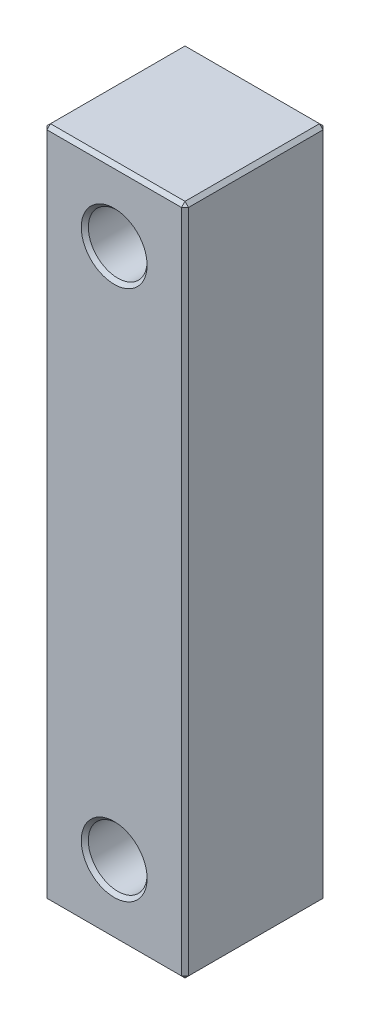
ISO-10303-21;
HEADER;
FILE_DESCRIPTION(('STEP AP214'),'2;1');
FILE_NAME('part.step','',(''),(''),'','','');
FILE_SCHEMA(('AUTOMOTIVE_DESIGN { 1 0 10303 214 1 1 1 1 }'));
ENDSEC;
DATA;
#1=APPLICATION_CONTEXT('core data for automotive mechanical design processes');
#2=APPLICATION_PROTOCOL_DEFINITION('international standard','automotive_design',2000,#1);
#3=PRODUCT_CONTEXT('',#1,'mechanical');
#4=PRODUCT('Part','Part','',(#3));
#5=PRODUCT_RELATED_PRODUCT_CATEGORY('part','',(#4));
#6=PRODUCT_DEFINITION_FORMATION('','',#4);
#7=PRODUCT_DEFINITION_CONTEXT('part definition',#1,'design');
#8=PRODUCT_DEFINITION('design','',#6,#7);
#9=PRODUCT_DEFINITION_SHAPE('','',#8);
#10=(LENGTH_UNIT() NAMED_UNIT(*) SI_UNIT(.MILLI.,.METRE.));
#11=(NAMED_UNIT(*) PLANE_ANGLE_UNIT() SI_UNIT($,.RADIAN.));
#12=(NAMED_UNIT(*) SI_UNIT($,.STERADIAN.) SOLID_ANGLE_UNIT());
#13=UNCERTAINTY_MEASURE_WITH_UNIT(LENGTH_MEASURE(1.E-05),#10,'distance_accuracy_value','');
#14=(GEOMETRIC_REPRESENTATION_CONTEXT(3) GLOBAL_UNCERTAINTY_ASSIGNED_CONTEXT((#13)) GLOBAL_UNIT_ASSIGNED_CONTEXT((#10,
#11,#12)) REPRESENTATION_CONTEXT('',''));
#15=CARTESIAN_POINT('',(0.,0.,0.));
#16=DIRECTION('',(0.,0.,1.));
#17=DIRECTION('',(1.,0.,0.));
#18=AXIS2_PLACEMENT_3D('',#15,#16,#17);
#19=CARTESIAN_POINT('',(-47.5000000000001,-47.5,-20.));
#20=DIRECTION('',(0.,0.,-1.));
#21=DIRECTION('',(-1.,0.,0.));
#22=AXIS2_PLACEMENT_3D('',#19,#20,#21);
#23=PLANE('',#22);
#24=CARTESIAN_POINT('',(-37.5000000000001,37.5,-20.));
#25=DIRECTION('',(0.,0.,-1.));
#26=DIRECTION('',(-1.,0.,0.));
#27=AXIS2_PLACEMENT_3D('',#24,#25,#26);
#28=CIRCLE('',#27,4.65);
#29=CARTESIAN_POINT('',(-42.1500000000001,37.5,-20.));
#30=VERTEX_POINT('',#29);
#31=EDGE_CURVE('E205',#30,#30,#28,.F.);
#32=ORIENTED_EDGE('',*,*,#31,.T.);
#33=EDGE_LOOP('',(#32));
#34=FACE_BOUND('',#33,.T.);
#35=CARTESIAN_POINT('',(-37.5000000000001,-37.5,-20.));
#36=DIRECTION('',(0.,0.,-1.));
#37=DIRECTION('',(-1.,0.,0.));
#38=AXIS2_PLACEMENT_3D('',#35,#36,#37);
#39=CIRCLE('',#38,4.65000000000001);
#40=CARTESIAN_POINT('',(-42.1500000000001,-37.5,-20.));
#41=VERTEX_POINT('',#40);
#42=EDGE_CURVE('E202',#41,#41,#39,.F.);
#43=ORIENTED_EDGE('',*,*,#42,.T.);
#44=EDGE_LOOP('',(#43));
#45=FACE_BOUND('',#44,.T.);
#46=DIRECTION('',(0.,-1.,0.));
#47=VECTOR('',#46,1.);
#48=CARTESIAN_POINT('',(-28.,-47.5000000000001,-20.));
#49=LINE('',#48,#47);
#50=CARTESIAN_POINT('',(-28.0000000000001,46.9999999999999,-20.));
#51=VERTEX_POINT('',#50);
#52=CARTESIAN_POINT('',(-28.0000000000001,-47.0000000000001,-20.));
#53=VERTEX_POINT('',#52);
#54=EDGE_CURVE('E197',#51,#53,#49,.T.);
#55=ORIENTED_EDGE('',*,*,#54,.T.);
#56=DIRECTION('',(-1.,0.,0.));
#57=VECTOR('',#56,1.);
#58=CARTESIAN_POINT('',(-47.5,-47.,-20.));
#59=LINE('',#58,#57);
#60=CARTESIAN_POINT('',(-47.0000000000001,-47.0000000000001,-20.));
#61=VERTEX_POINT('',#60);
#62=EDGE_CURVE('E199',#53,#61,#59,.T.);
#63=ORIENTED_EDGE('',*,*,#62,.T.);
#64=DIRECTION('',(0.,0.999999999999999,0.));
#65=VECTOR('',#64,1.);
#66=CARTESIAN_POINT('',(-47.,-47.5000000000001,-20.));
#67=LINE('',#66,#65);
#68=CARTESIAN_POINT('',(-47.0000000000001,46.9999999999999,-20.));
#69=VERTEX_POINT('',#68);
#70=EDGE_CURVE('E193',#61,#69,#67,.T.);
#71=ORIENTED_EDGE('',*,*,#70,.T.);
#72=DIRECTION('',(1.,0.,0.));
#73=VECTOR('',#72,1.);
#74=CARTESIAN_POINT('',(-27.5000000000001,47.,-20.));
#75=LINE('',#74,#73);
#76=EDGE_CURVE('E195',#69,#51,#75,.T.);
#77=ORIENTED_EDGE('',*,*,#76,.T.);
#78=EDGE_LOOP('',(#55,#63,#71,#77));
#79=FACE_BOUND('',#78,.T.);
#80=ADVANCED_FACE('F34',(#34,#45,#79),#23,.T.);
#81=CARTESIAN_POINT('',(-47.5000000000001,-47.5,0.));
#82=DIRECTION('',(0.,0.,-1.));
#83=DIRECTION('',(-1.,0.,0.));
#84=AXIS2_PLACEMENT_3D('',#81,#82,#83);
#85=PLANE('',#84);
#86=CARTESIAN_POINT('',(-37.5000000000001,37.5,0.));
#87=DIRECTION('',(0.,0.,-1.));
#88=DIRECTION('',(-1.,0.,0.));
#89=AXIS2_PLACEMENT_3D('',#86,#87,#88);
#90=CIRCLE('',#89,4.65000000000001);
#91=CARTESIAN_POINT('',(-42.1500000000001,37.4999999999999,0.));
#92=VERTEX_POINT('',#91);
#93=EDGE_CURVE('E11',#92,#92,#90,.T.);
#94=ORIENTED_EDGE('',*,*,#93,.T.);
#95=EDGE_LOOP('',(#94));
#96=FACE_BOUND('',#95,.T.);
#97=CARTESIAN_POINT('',(-37.5000000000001,-37.5,0.));
#98=DIRECTION('',(0.,0.,-1.));
#99=DIRECTION('',(-1.,0.,0.));
#100=AXIS2_PLACEMENT_3D('',#97,#98,#99);
#101=CIRCLE('',#100,4.65);
#102=CARTESIAN_POINT('',(-42.1500000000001,-37.5,0.));
#103=VERTEX_POINT('',#102);
#104=EDGE_CURVE('E42',#103,#103,#101,.T.);
#105=ORIENTED_EDGE('',*,*,#104,.T.);
#106=EDGE_LOOP('',(#105));
#107=FACE_BOUND('',#106,.T.);
#108=DIRECTION('',(0.,1.,0.));
#109=VECTOR('',#108,1.);
#110=CARTESIAN_POINT('',(-28.0000000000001,47.5,0.));
#111=LINE('',#110,#109);
#112=CARTESIAN_POINT('',(-28.0000000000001,-47.,0.));
#113=VERTEX_POINT('',#112);
#114=CARTESIAN_POINT('',(-28.0000000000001,47.,0.));
#115=VERTEX_POINT('',#114);
#116=EDGE_CURVE('E49',#113,#115,#111,.T.);
#117=ORIENTED_EDGE('',*,*,#116,.T.);
#118=DIRECTION('',(-1.,0.,0.));
#119=VECTOR('',#118,1.);
#120=CARTESIAN_POINT('',(-47.5000000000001,47.,0.));
#121=LINE('',#120,#119);
#122=CARTESIAN_POINT('',(-47.0000000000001,46.9999999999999,0.));
#123=VERTEX_POINT('',#122);
#124=EDGE_CURVE('E218',#115,#123,#121,.T.);
#125=ORIENTED_EDGE('',*,*,#124,.T.);
#126=DIRECTION('',(0.,-0.999999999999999,0.));
#127=VECTOR('',#126,1.);
#128=CARTESIAN_POINT('',(-47.,-47.5,0.));
#129=LINE('',#128,#127);
#130=CARTESIAN_POINT('',(-47.0000000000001,-47.0000000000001,0.));
#131=VERTEX_POINT('',#130);
#132=EDGE_CURVE('E214',#123,#131,#129,.T.);
#133=ORIENTED_EDGE('',*,*,#132,.T.);
#134=DIRECTION('',(1.,0.,0.));
#135=VECTOR('',#134,1.);
#136=CARTESIAN_POINT('',(-47.5,-47.0000000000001,0.));
#137=LINE('',#136,#135);
#138=EDGE_CURVE('E54',#131,#113,#137,.T.);
#139=ORIENTED_EDGE('',*,*,#138,.T.);
#140=EDGE_LOOP('',(#117,#125,#133,#139));
#141=FACE_BOUND('',#140,.T.);
#142=ADVANCED_FACE('F222',(#96,#107,#141),#85,.F.);
#143=CARTESIAN_POINT('',(-47.5000000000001,47.4999999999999,-20.));
#144=DIRECTION('',(-1.,0.,0.));
#145=DIRECTION('',(0.,-0.999999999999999,0.));
#146=AXIS2_PLACEMENT_3D('',#143,#144,#145);
#147=PLANE('',#146);
#148=DIRECTION('',(0.,0.,-1.));
#149=VECTOR('',#148,1.);
#150=CARTESIAN_POINT('',(-47.5000000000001,46.9999999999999,-20.));
#151=LINE('',#150,#149);
#152=CARTESIAN_POINT('',(-47.5000000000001,46.9999999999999,-0.5));
#153=VERTEX_POINT('',#152);
#154=CARTESIAN_POINT('',(-47.5000000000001,47.,-19.5));
#155=VERTEX_POINT('',#154);
#156=EDGE_CURVE('E173',#153,#155,#151,.T.);
#157=ORIENTED_EDGE('',*,*,#156,.T.);
#158=DIRECTION('',(0.,-0.999999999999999,0.));
#159=VECTOR('',#158,1.);
#160=CARTESIAN_POINT('',(-47.5000000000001,47.4999999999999,-19.5));
#161=LINE('',#160,#159);
#162=CARTESIAN_POINT('',(-47.5000000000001,-47.0000000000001,-19.5));
#163=VERTEX_POINT('',#162);
#164=EDGE_CURVE('E176',#155,#163,#161,.T.);
#165=ORIENTED_EDGE('',*,*,#164,.T.);
#166=DIRECTION('',(0.,0.,1.));
#167=VECTOR('',#166,1.);
#168=CARTESIAN_POINT('',(-47.5,-47.0000000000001,0.));
#169=LINE('',#168,#167);
#170=CARTESIAN_POINT('',(-47.5,-47.0000000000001,-0.499999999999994));
#171=VERTEX_POINT('',#170);
#172=EDGE_CURVE('E171',#163,#171,#169,.T.);
#173=ORIENTED_EDGE('',*,*,#172,.T.);
#174=DIRECTION('',(0.,0.999999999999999,0.));
#175=VECTOR('',#174,1.);
#176=CARTESIAN_POINT('',(-47.5000000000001,47.4999999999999,-0.499999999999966));
#177=LINE('',#176,#175);
#178=EDGE_CURVE('E169',#171,#153,#177,.T.);
#179=ORIENTED_EDGE('',*,*,#178,.T.);
#180=EDGE_LOOP('',(#157,#165,#173,#179));
#181=FACE_BOUND('',#180,.T.);
#182=ADVANCED_FACE('F253',(#181),#147,.T.);
#183=CARTESIAN_POINT('',(-47.5000000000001,47.4999999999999,-20.));
#184=DIRECTION('',(0.,-1.,0.));
#185=DIRECTION('',(1.,0.,0.));
#186=AXIS2_PLACEMENT_3D('',#183,#184,#185);
#187=PLANE('',#186);
#188=DIRECTION('',(0.,0.,-1.));
#189=VECTOR('',#188,1.);
#190=CARTESIAN_POINT('',(-28.0000000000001,47.5,-20.));
#191=LINE('',#190,#189);
#192=CARTESIAN_POINT('',(-28.0000000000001,47.5,-0.500000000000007));
#193=VERTEX_POINT('',#192);
#194=CARTESIAN_POINT('',(-28.0000000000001,47.5,-19.5));
#195=VERTEX_POINT('',#194);
#196=EDGE_CURVE('E130',#193,#195,#191,.T.);
#197=ORIENTED_EDGE('',*,*,#196,.T.);
#198=DIRECTION('',(-1.,0.,0.));
#199=VECTOR('',#198,1.);
#200=CARTESIAN_POINT('',(-47.5000000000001,47.4999999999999,-19.5));
#201=LINE('',#200,#199);
#202=CARTESIAN_POINT('',(-47.0000000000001,47.4999999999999,-19.5));
#203=VERTEX_POINT('',#202);
#204=EDGE_CURVE('E167',#195,#203,#201,.T.);
#205=ORIENTED_EDGE('',*,*,#204,.T.);
#206=DIRECTION('',(0.,0.,1.));
#207=VECTOR('',#206,1.);
#208=CARTESIAN_POINT('',(-47.0000000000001,47.5,0.));
#209=LINE('',#208,#207);
#210=CARTESIAN_POINT('',(-47.0000000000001,47.5,-0.500000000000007));
#211=VERTEX_POINT('',#210);
#212=EDGE_CURVE('E164',#203,#211,#209,.T.);
#213=ORIENTED_EDGE('',*,*,#212,.T.);
#214=DIRECTION('',(1.,0.,0.));
#215=VECTOR('',#214,1.);
#216=CARTESIAN_POINT('',(-47.5000000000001,47.4999999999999,-0.499999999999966));
#217=LINE('',#216,#215);
#218=EDGE_CURVE('E159',#211,#193,#217,.T.);
#219=ORIENTED_EDGE('',*,*,#218,.T.);
#220=EDGE_LOOP('',(#197,#205,#213,#219));
#221=FACE_BOUND('',#220,.T.);
#222=ADVANCED_FACE('F36',(#221),#187,.F.);
#223=CARTESIAN_POINT('',(-27.5000000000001,-47.5,-20.));
#224=DIRECTION('',(1.,0.,0.));
#225=DIRECTION('',(0.,0.,-1.));
#226=AXIS2_PLACEMENT_3D('',#223,#224,#225);
#227=PLANE('',#226);
#228=DIRECTION('',(0.,0.,-1.));
#229=VECTOR('',#228,1.);
#230=CARTESIAN_POINT('',(-27.5000000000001,-47.0000000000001,-20.));
#231=LINE('',#230,#229);
#232=CARTESIAN_POINT('',(-27.5000000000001,-47.,-0.500000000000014));
#233=VERTEX_POINT('',#232);
#234=CARTESIAN_POINT('',(-27.5000000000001,-47.,-19.5));
#235=VERTEX_POINT('',#234);
#236=EDGE_CURVE('E151',#233,#235,#231,.T.);
#237=ORIENTED_EDGE('',*,*,#236,.T.);
#238=DIRECTION('',(0.,1.,0.));
#239=VECTOR('',#238,1.);
#240=CARTESIAN_POINT('',(-27.5000000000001,-47.5,-19.5));
#241=LINE('',#240,#239);
#242=CARTESIAN_POINT('',(-27.5000000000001,47.,-19.5));
#243=VERTEX_POINT('',#242);
#244=EDGE_CURVE('E156',#235,#243,#241,.T.);
#245=ORIENTED_EDGE('',*,*,#244,.T.);
#246=DIRECTION('',(0.,0.,1.));
#247=VECTOR('',#246,1.);
#248=CARTESIAN_POINT('',(-27.5000000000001,47.,0.));
#249=LINE('',#248,#247);
#250=CARTESIAN_POINT('',(-27.5000000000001,47.,-0.499999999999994));
#251=VERTEX_POINT('',#250);
#252=EDGE_CURVE('E128',#243,#251,#249,.T.);
#253=ORIENTED_EDGE('',*,*,#252,.T.);
#254=DIRECTION('',(0.,-1.,0.));
#255=VECTOR('',#254,1.);
#256=CARTESIAN_POINT('',(-27.5000000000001,-47.5000000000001,-0.500000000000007));
#257=LINE('',#256,#255);
#258=EDGE_CURVE('E145',#251,#233,#257,.T.);
#259=ORIENTED_EDGE('',*,*,#258,.T.);
#260=EDGE_LOOP('',(#237,#245,#253,#259));
#261=FACE_BOUND('',#260,.T.);
#262=ADVANCED_FACE('F154',(#261),#227,.T.);
#263=CARTESIAN_POINT('',(-27.5000000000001,-47.5,-20.));
#264=DIRECTION('',(0.,1.,0.));
#265=DIRECTION('',(-1.,0.,0.));
#266=AXIS2_PLACEMENT_3D('',#263,#264,#265);
#267=PLANE('',#266);
#268=DIRECTION('',(0.,0.,-1.));
#269=VECTOR('',#268,1.);
#270=CARTESIAN_POINT('',(-47.,-47.5000000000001,-20.));
#271=LINE('',#270,#269);
#272=CARTESIAN_POINT('',(-47.0000000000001,-47.5,-0.500000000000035));
#273=VERTEX_POINT('',#272);
#274=CARTESIAN_POINT('',(-47.0000000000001,-47.5,-19.5));
#275=VERTEX_POINT('',#274);
#276=EDGE_CURVE('E182',#273,#275,#271,.T.);
#277=ORIENTED_EDGE('',*,*,#276,.T.);
#278=DIRECTION('',(1.,0.,0.));
#279=VECTOR('',#278,1.);
#280=CARTESIAN_POINT('',(-27.5000000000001,-47.5,-19.5));
#281=LINE('',#280,#279);
#282=CARTESIAN_POINT('',(-28.0000000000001,-47.5000000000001,-19.5));
#283=VERTEX_POINT('',#282);
#284=EDGE_CURVE('E185',#275,#283,#281,.T.);
#285=ORIENTED_EDGE('',*,*,#284,.T.);
#286=DIRECTION('',(0.,0.,1.));
#287=VECTOR('',#286,1.);
#288=CARTESIAN_POINT('',(-28.0000000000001,-47.5,0.));
#289=LINE('',#288,#287);
#290=CARTESIAN_POINT('',(-28.,-47.5000000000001,-0.500000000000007));
#291=VERTEX_POINT('',#290);
#292=EDGE_CURVE('E180',#283,#291,#289,.T.);
#293=ORIENTED_EDGE('',*,*,#292,.T.);
#294=DIRECTION('',(-1.,0.,0.));
#295=VECTOR('',#294,1.);
#296=CARTESIAN_POINT('',(-27.5000000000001,-47.5,-0.500000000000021));
#297=LINE('',#296,#295);
#298=EDGE_CURVE('E178',#291,#273,#297,.T.);
#299=ORIENTED_EDGE('',*,*,#298,.T.);
#300=EDGE_LOOP('',(#277,#285,#293,#299));
#301=FACE_BOUND('',#300,.T.);
#302=ADVANCED_FACE('F234',(#301),#267,.F.);
#303=CARTESIAN_POINT('',(-37.5000000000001,-37.5,-20.));
#304=DIRECTION('',(0.,0.,1.));
#305=DIRECTION('',(1.,0.,0.));
#306=AXIS2_PLACEMENT_3D('',#303,#304,#305);
#307=CYLINDRICAL_SURFACE('',#306,4.15);
#308=CARTESIAN_POINT('',(-37.5000000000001,-37.5,-19.5));
#309=DIRECTION('',(0.,0.,-1.));
#310=DIRECTION('',(-1.,0.,0.));
#311=AXIS2_PLACEMENT_3D('',#308,#309,#310);
#312=CIRCLE('',#311,4.15);
#313=CARTESIAN_POINT('',(-41.6500000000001,-37.5,-19.5));
#314=VERTEX_POINT('',#313);
#315=EDGE_CURVE('E211',#314,#314,#312,.T.);
#316=ORIENTED_EDGE('',*,*,#315,.T.);
#317=EDGE_LOOP('',(#316));
#318=FACE_BOUND('',#317,.T.);
#319=CARTESIAN_POINT('',(-37.5000000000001,-37.5000000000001,-0.500000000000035));
#320=DIRECTION('',(0.,0.,-1.));
#321=DIRECTION('',(-1.,0.,0.));
#322=AXIS2_PLACEMENT_3D('',#319,#320,#321);
#323=CIRCLE('',#322,4.15);
#324=CARTESIAN_POINT('',(-41.6500000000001,-37.5000000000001,-0.500000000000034));
#325=VERTEX_POINT('',#324);
#326=EDGE_CURVE('E208',#325,#325,#323,.F.);
#327=ORIENTED_EDGE('',*,*,#326,.T.);
#328=EDGE_LOOP('',(#327));
#329=FACE_BOUND('',#328,.T.);
#330=ADVANCED_FACE('F231',(#318,#329),#307,.F.);
#331=CARTESIAN_POINT('',(-37.5000000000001,37.5,-20.));
#332=DIRECTION('',(0.,0.,1.));
#333=DIRECTION('',(1.,0.,0.));
#334=AXIS2_PLACEMENT_3D('',#331,#332,#333);
#335=CYLINDRICAL_SURFACE('',#334,4.15);
#336=CARTESIAN_POINT('',(-37.5000000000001,37.5,-19.5));
#337=DIRECTION('',(0.,0.,-1.));
#338=DIRECTION('',(-1.,0.,0.));
#339=AXIS2_PLACEMENT_3D('',#336,#337,#338);
#340=CIRCLE('',#339,4.15);
#341=CARTESIAN_POINT('',(-41.6500000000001,37.5,-19.5));
#342=VERTEX_POINT('',#341);
#343=EDGE_CURVE('E190',#342,#342,#340,.T.);
#344=ORIENTED_EDGE('',*,*,#343,.T.);
#345=EDGE_LOOP('',(#344));
#346=FACE_BOUND('',#345,.T.);
#347=CARTESIAN_POINT('',(-37.5000000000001,37.5,-0.500000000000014));
#348=DIRECTION('',(0.,0.,-1.));
#349=DIRECTION('',(-1.,0.,0.));
#350=AXIS2_PLACEMENT_3D('',#347,#348,#349);
#351=CIRCLE('',#350,4.15);
#352=CARTESIAN_POINT('',(-41.6500000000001,37.5,-0.500000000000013));
#353=VERTEX_POINT('',#352);
#354=EDGE_CURVE('E187',#353,#353,#351,.F.);
#355=ORIENTED_EDGE('',*,*,#354,.T.);
#356=EDGE_LOOP('',(#355));
#357=FACE_BOUND('',#356,.T.);
#358=ADVANCED_FACE('F233',(#346,#357),#335,.F.);
#359=CARTESIAN_POINT('',(-47.5,-47.,-20.));
#360=DIRECTION('',(-0.707106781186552,-0.707106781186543,0.));
#361=DIRECTION('',(0.707106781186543,-0.707106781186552,0.));
#362=AXIS2_PLACEMENT_3D('',#359,#360,#361);
#363=PLANE('',#362);
#364=DIRECTION('',(-0.707106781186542,0.707106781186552,0.));
#365=VECTOR('',#364,1.);
#366=CARTESIAN_POINT('',(-47.0000000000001,-47.5,-19.5));
#367=LINE('',#366,#365);
#368=EDGE_CURVE('E152',#275,#163,#367,.T.);
#369=ORIENTED_EDGE('',*,*,#368,.F.);
#370=ORIENTED_EDGE('',*,*,#276,.F.);
#371=DIRECTION('',(0.707106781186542,-0.707106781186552,0.));
#372=VECTOR('',#371,1.);
#373=CARTESIAN_POINT('',(-47.5,-47.0000000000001,-0.499999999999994));
#374=LINE('',#373,#372);
#375=EDGE_CURVE('E324',#171,#273,#374,.T.);
#376=ORIENTED_EDGE('',*,*,#375,.F.);
#377=ORIENTED_EDGE('',*,*,#172,.F.);
#378=EDGE_LOOP('',(#369,#370,#376,#377));
#379=FACE_BOUND('',#378,.T.);
#380=ADVANCED_FACE('F241',(#379),#363,.T.);
#381=CARTESIAN_POINT('',(-47.0000000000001,-47.5,-19.5));
#382=DIRECTION('',(-0.577350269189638,-0.577350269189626,-0.577350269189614));
#383=DIRECTION('',(0.70710678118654,-0.707106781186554,0.));
#384=AXIS2_PLACEMENT_3D('',#381,#382,#383);
#385=PLANE('',#384);
#386=DIRECTION('',(0.,-0.707106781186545,0.70710678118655));
#387=VECTOR('',#386,1.);
#388=CARTESIAN_POINT('',(-47.0000000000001,-47.5,-19.5));
#389=LINE('',#388,#387);
#390=EDGE_CURVE('E318',#275,#61,#389,.F.);
#391=ORIENTED_EDGE('',*,*,#390,.F.);
#392=ORIENTED_EDGE('',*,*,#368,.T.);
#393=DIRECTION('',(-0.707106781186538,0.,0.707106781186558));
#394=VECTOR('',#393,1.);
#395=CARTESIAN_POINT('',(-47.2500000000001,-47.,-19.75));
#396=LINE('',#395,#394);
#397=EDGE_CURVE('E321',#61,#163,#396,.T.);
#398=ORIENTED_EDGE('',*,*,#397,.F.);
#399=EDGE_LOOP('',(#391,#392,#398));
#400=FACE_BOUND('',#399,.T.);
#401=ADVANCED_FACE('F332',(#400),#385,.T.);
#402=CARTESIAN_POINT('',(-47.5,-47.0000000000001,-0.499999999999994));
#403=DIRECTION('',(-0.577350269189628,-0.577350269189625,0.577350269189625));
#404=DIRECTION('',(0.707106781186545,0.,0.70710678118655));
#405=AXIS2_PLACEMENT_3D('',#402,#403,#404);
#406=PLANE('',#405);
#407=DIRECTION('',(-0.70710678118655,0.,-0.707106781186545));
#408=VECTOR('',#407,1.);
#409=CARTESIAN_POINT('',(-47.5,-47.0000000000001,-0.499999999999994));
#410=LINE('',#409,#408);
#411=EDGE_CURVE('E312',#171,#131,#410,.F.);
#412=ORIENTED_EDGE('',*,*,#411,.F.);
#413=ORIENTED_EDGE('',*,*,#375,.T.);
#414=DIRECTION('',(0.,-0.707106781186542,-0.707106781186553));
#415=VECTOR('',#414,1.);
#416=CARTESIAN_POINT('',(-47.0000000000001,-47.2500000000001,-0.250000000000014));
#417=LINE('',#416,#415);
#418=EDGE_CURVE('E315',#131,#273,#417,.T.);
#419=ORIENTED_EDGE('',*,*,#418,.F.);
#420=EDGE_LOOP('',(#412,#413,#419));
#421=FACE_BOUND('',#420,.T.);
#422=ADVANCED_FACE('F377',(#421),#406,.T.);
#423=CARTESIAN_POINT('',(-47.5000000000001,47.4999999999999,-19.5));
#424=DIRECTION('',(0.707106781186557,0.,0.707106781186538));
#425=DIRECTION('',(0.707106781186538,0.,-0.707106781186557));
#426=AXIS2_PLACEMENT_3D('',#423,#424,#425);
#427=PLANE('',#426);
#428=ORIENTED_EDGE('',*,*,#397,.T.);
#429=ORIENTED_EDGE('',*,*,#164,.F.);
#430=DIRECTION('',(0.707106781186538,0.,-0.707106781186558));
#431=VECTOR('',#430,1.);
#432=CARTESIAN_POINT('',(-47.5000000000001,47.,-19.5));
#433=LINE('',#432,#431);
#434=EDGE_CURVE('E307',#69,#155,#433,.F.);
#435=ORIENTED_EDGE('',*,*,#434,.F.);
#436=ORIENTED_EDGE('',*,*,#70,.F.);
#437=EDGE_LOOP('',(#428,#429,#435,#436));
#438=FACE_BOUND('',#437,.T.);
#439=ADVANCED_FACE('F338',(#438),#427,.F.);
#440=CARTESIAN_POINT('',(-47.5,-47.,-20.));
#441=DIRECTION('',(0.,-0.70710678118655,-0.707106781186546));
#442=DIRECTION('',(0.,0.707106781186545,-0.70710678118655));
#443=AXIS2_PLACEMENT_3D('',#440,#441,#442);
#444=PLANE('',#443);
#445=ORIENTED_EDGE('',*,*,#390,.T.);
#446=ORIENTED_EDGE('',*,*,#62,.F.);
#447=DIRECTION('',(0.,0.707106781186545,-0.707106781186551));
#448=VECTOR('',#447,1.);
#449=CARTESIAN_POINT('',(-28.0000000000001,-47.2500000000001,-19.75));
#450=LINE('',#449,#448);
#451=EDGE_CURVE('E304',#283,#53,#450,.T.);
#452=ORIENTED_EDGE('',*,*,#451,.F.);
#453=ORIENTED_EDGE('',*,*,#284,.F.);
#454=EDGE_LOOP('',(#445,#446,#452,#453));
#455=FACE_BOUND('',#454,.T.);
#456=ADVANCED_FACE('F347',(#455),#444,.T.);
#457=CARTESIAN_POINT('',(-28.,-47.5000000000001,-20.));
#458=DIRECTION('',(0.707106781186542,-0.707106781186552,0.));
#459=DIRECTION('',(0.707106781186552,0.707106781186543,0.));
#460=AXIS2_PLACEMENT_3D('',#457,#458,#459);
#461=PLANE('',#460);
#462=DIRECTION('',(0.707106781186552,0.707106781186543,0.));
#463=VECTOR('',#462,1.);
#464=CARTESIAN_POINT('',(-28.,-47.5000000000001,-0.500000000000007));
#465=LINE('',#464,#463);
#466=EDGE_CURVE('E298',#291,#233,#465,.T.);
#467=ORIENTED_EDGE('',*,*,#466,.F.);
#468=ORIENTED_EDGE('',*,*,#292,.F.);
#469=DIRECTION('',(-0.707106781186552,-0.707106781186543,0.));
#470=VECTOR('',#469,1.);
#471=CARTESIAN_POINT('',(-27.5000000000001,-47.,-19.5));
#472=LINE('',#471,#470);
#473=EDGE_CURVE('E301',#235,#283,#472,.T.);
#474=ORIENTED_EDGE('',*,*,#473,.F.);
#475=ORIENTED_EDGE('',*,*,#236,.F.);
#476=EDGE_LOOP('',(#467,#468,#474,#475));
#477=FACE_BOUND('',#476,.T.);
#478=ADVANCED_FACE('F387',(#477),#461,.T.);
#479=CARTESIAN_POINT('',(-27.5000000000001,-47.5,-0.500000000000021));
#480=DIRECTION('',(0.,0.707106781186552,-0.707106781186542));
#481=DIRECTION('',(0.,0.707106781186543,0.707106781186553));
#482=AXIS2_PLACEMENT_3D('',#479,#480,#481);
#483=PLANE('',#482);
#484=ORIENTED_EDGE('',*,*,#418,.T.);
#485=ORIENTED_EDGE('',*,*,#298,.F.);
#486=DIRECTION('',(0.,0.707106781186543,0.707106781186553));
#487=VECTOR('',#486,1.);
#488=CARTESIAN_POINT('',(-28.,-47.5000000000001,-0.500000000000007));
#489=LINE('',#488,#487);
#490=EDGE_CURVE('E295',#113,#291,#489,.F.);
#491=ORIENTED_EDGE('',*,*,#490,.F.);
#492=ORIENTED_EDGE('',*,*,#138,.F.);
#493=EDGE_LOOP('',(#484,#485,#491,#492));
#494=FACE_BOUND('',#493,.T.);
#495=ADVANCED_FACE('F381',(#494),#483,.F.);
#496=CARTESIAN_POINT('',(-47.,-47.5,0.));
#497=DIRECTION('',(-0.707106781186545,0.,0.70710678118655));
#498=DIRECTION('',(0.70710678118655,0.,0.707106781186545));
#499=AXIS2_PLACEMENT_3D('',#496,#497,#498);
#500=PLANE('',#499);
#501=ORIENTED_EDGE('',*,*,#411,.T.);
#502=ORIENTED_EDGE('',*,*,#132,.F.);
#503=DIRECTION('',(0.70710678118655,0.,0.707106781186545));
#504=VECTOR('',#503,1.);
#505=CARTESIAN_POINT('',(-47.2500000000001,46.9999999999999,-0.25));
#506=LINE('',#505,#504);
#507=EDGE_CURVE('E292',#153,#123,#506,.T.);
#508=ORIENTED_EDGE('',*,*,#507,.F.);
#509=ORIENTED_EDGE('',*,*,#178,.F.);
#510=EDGE_LOOP('',(#501,#502,#508,#509));
#511=FACE_BOUND('',#510,.T.);
#512=ADVANCED_FACE('F373',(#511),#500,.T.);
#513=CARTESIAN_POINT('',(-47.0000000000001,47.5,-20.));
#514=DIRECTION('',(-0.707106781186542,0.707106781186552,0.));
#515=DIRECTION('',(-0.707106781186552,-0.707106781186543,0.));
#516=AXIS2_PLACEMENT_3D('',#513,#514,#515);
#517=PLANE('',#516);
#518=DIRECTION('',(0.707106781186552,0.707106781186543,0.));
#519=VECTOR('',#518,1.);
#520=CARTESIAN_POINT('',(-47.5000000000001,47.,-19.5));
#521=LINE('',#520,#519);
#522=EDGE_CURVE('E309',#155,#203,#521,.T.);
#523=ORIENTED_EDGE('',*,*,#522,.F.);
#524=ORIENTED_EDGE('',*,*,#156,.F.);
#525=DIRECTION('',(-0.707106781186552,-0.707106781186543,0.));
#526=VECTOR('',#525,1.);
#527=CARTESIAN_POINT('',(-47.0000000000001,47.5,-0.500000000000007));
#528=LINE('',#527,#526);
#529=EDGE_CURVE('E289',#211,#153,#528,.T.);
#530=ORIENTED_EDGE('',*,*,#529,.F.);
#531=ORIENTED_EDGE('',*,*,#212,.F.);
#532=EDGE_LOOP('',(#523,#524,#530,#531));
#533=FACE_BOUND('',#532,.T.);
#534=ADVANCED_FACE('F365',(#533),#517,.T.);
#535=CARTESIAN_POINT('',(-47.5000000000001,47.,-19.5));
#536=DIRECTION('',(-0.577350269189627,0.57735026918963,-0.577350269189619));
#537=DIRECTION('',(-0.70710678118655,-0.707106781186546,0.));
#538=AXIS2_PLACEMENT_3D('',#535,#536,#537);
#539=PLANE('',#538);
#540=ORIENTED_EDGE('',*,*,#434,.T.);
#541=ORIENTED_EDGE('',*,*,#522,.T.);
#542=DIRECTION('',(0.,-0.70710678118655,-0.707106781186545));
#543=VECTOR('',#542,1.);
#544=CARTESIAN_POINT('',(-47.0000000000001,47.25,-19.75));
#545=LINE('',#544,#543);
#546=EDGE_CURVE('E286',#69,#203,#545,.F.);
#547=ORIENTED_EDGE('',*,*,#546,.F.);
#548=EDGE_LOOP('',(#540,#541,#547));
#549=FACE_BOUND('',#548,.T.);
#550=ADVANCED_FACE('F361',(#549),#539,.T.);
#551=CARTESIAN_POINT('',(-27.5000000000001,-47.,-19.5));
#552=DIRECTION('',(0.577350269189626,-0.577350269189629,-0.577350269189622));
#553=DIRECTION('',(0.70710678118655,0.707106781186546,0.));
#554=AXIS2_PLACEMENT_3D('',#551,#552,#553);
#555=PLANE('',#554);
#556=ORIENTED_EDGE('',*,*,#473,.T.);
#557=ORIENTED_EDGE('',*,*,#451,.T.);
#558=DIRECTION('',(-0.707106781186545,0.,-0.70710678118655));
#559=VECTOR('',#558,1.);
#560=CARTESIAN_POINT('',(-27.5000000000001,-47.,-19.5));
#561=LINE('',#560,#559);
#562=EDGE_CURVE('E283',#235,#53,#561,.T.);
#563=ORIENTED_EDGE('',*,*,#562,.F.);
#564=EDGE_LOOP('',(#556,#557,#563));
#565=FACE_BOUND('',#564,.T.);
#566=ADVANCED_FACE('F350',(#565),#555,.T.);
#567=CARTESIAN_POINT('',(-28.,-47.5000000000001,-0.500000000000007));
#568=DIRECTION('',(0.577350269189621,-0.577350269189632,0.577350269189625));
#569=DIRECTION('',(0.,-0.707106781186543,-0.707106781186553));
#570=AXIS2_PLACEMENT_3D('',#567,#568,#569);
#571=PLANE('',#570);
#572=ORIENTED_EDGE('',*,*,#490,.T.);
#573=ORIENTED_EDGE('',*,*,#466,.T.);
#574=DIRECTION('',(-0.70710678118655,0.,0.707106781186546));
#575=VECTOR('',#574,1.);
#576=CARTESIAN_POINT('',(-27.7500000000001,-47.,-0.250000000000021));
#577=LINE('',#576,#575);
#578=EDGE_CURVE('E148',#113,#233,#577,.F.);
#579=ORIENTED_EDGE('',*,*,#578,.F.);
#580=EDGE_LOOP('',(#572,#573,#579));
#581=FACE_BOUND('',#580,.T.);
#582=ADVANCED_FACE('F384',(#581),#571,.T.);
#583=CARTESIAN_POINT('',(-47.0000000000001,47.5,-0.500000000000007));
#584=DIRECTION('',(-0.577350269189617,0.57735026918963,0.57735026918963));
#585=DIRECTION('',(0.,-0.707106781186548,0.707106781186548));
#586=AXIS2_PLACEMENT_3D('',#583,#584,#585);
#587=PLANE('',#586);
#588=ORIENTED_EDGE('',*,*,#529,.T.);
#589=ORIENTED_EDGE('',*,*,#507,.T.);
#590=DIRECTION('',(0.,-0.707106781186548,0.707106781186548));
#591=VECTOR('',#590,1.);
#592=CARTESIAN_POINT('',(-47.0000000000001,47.5,-0.500000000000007));
#593=LINE('',#592,#591);
#594=EDGE_CURVE('E280',#211,#123,#593,.T.);
#595=ORIENTED_EDGE('',*,*,#594,.F.);
#596=EDGE_LOOP('',(#588,#589,#595));
#597=FACE_BOUND('',#596,.T.);
#598=ADVANCED_FACE('F369',(#597),#587,.T.);
#599=CARTESIAN_POINT('',(-47.5000000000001,46.9999999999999,-20.));
#600=DIRECTION('',(0.,0.707106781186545,-0.70710678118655));
#601=DIRECTION('',(0.,0.70710678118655,0.707106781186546));
#602=AXIS2_PLACEMENT_3D('',#599,#600,#601);
#603=PLANE('',#602);
#604=ORIENTED_EDGE('',*,*,#546,.T.);
#605=ORIENTED_EDGE('',*,*,#204,.F.);
#606=DIRECTION('',(0.,0.70710678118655,0.707106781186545));
#607=VECTOR('',#606,1.);
#608=CARTESIAN_POINT('',(-28.0000000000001,47.5,-19.5));
#609=LINE('',#608,#607);
#610=EDGE_CURVE('E277',#51,#195,#609,.T.);
#611=ORIENTED_EDGE('',*,*,#610,.F.);
#612=ORIENTED_EDGE('',*,*,#76,.F.);
#613=EDGE_LOOP('',(#604,#605,#611,#612));
#614=FACE_BOUND('',#613,.T.);
#615=ADVANCED_FACE('F359',(#614),#603,.T.);
#616=CARTESIAN_POINT('',(-27.5000000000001,-47.5,-19.5));
#617=DIRECTION('',(-0.707106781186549,0.,0.707106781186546));
#618=DIRECTION('',(0.707106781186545,0.,0.70710678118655));
#619=AXIS2_PLACEMENT_3D('',#616,#617,#618);
#620=PLANE('',#619);
#621=ORIENTED_EDGE('',*,*,#562,.T.);
#622=ORIENTED_EDGE('',*,*,#54,.F.);
#623=DIRECTION('',(0.707106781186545,0.,0.70710678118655));
#624=VECTOR('',#623,1.);
#625=CARTESIAN_POINT('',(-27.7500000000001,47.,-19.75));
#626=LINE('',#625,#624);
#627=EDGE_CURVE('E142',#243,#51,#626,.F.);
#628=ORIENTED_EDGE('',*,*,#627,.F.);
#629=ORIENTED_EDGE('',*,*,#244,.F.);
#630=EDGE_LOOP('',(#621,#622,#628,#629));
#631=FACE_BOUND('',#630,.T.);
#632=ADVANCED_FACE('F353',(#631),#620,.F.);
#633=CARTESIAN_POINT('',(-28.0000000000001,-47.5,0.));
#634=DIRECTION('',(0.707106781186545,0.,0.70710678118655));
#635=DIRECTION('',(0.70710678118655,0.,-0.707106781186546));
#636=AXIS2_PLACEMENT_3D('',#633,#634,#635);
#637=PLANE('',#636);
#638=ORIENTED_EDGE('',*,*,#578,.T.);
#639=ORIENTED_EDGE('',*,*,#258,.F.);
#640=DIRECTION('',(0.70710678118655,0.,-0.707106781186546));
#641=VECTOR('',#640,1.);
#642=CARTESIAN_POINT('',(-27.5000000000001,47.,-0.499999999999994));
#643=LINE('',#642,#641);
#644=EDGE_CURVE('E136',#115,#251,#643,.T.);
#645=ORIENTED_EDGE('',*,*,#644,.F.);
#646=ORIENTED_EDGE('',*,*,#116,.F.);
#647=EDGE_LOOP('',(#638,#639,#645,#646));
#648=FACE_BOUND('',#647,.T.);
#649=ADVANCED_FACE('F146',(#648),#637,.T.);
#650=CARTESIAN_POINT('',(-47.5000000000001,47.4999999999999,-0.499999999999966));
#651=DIRECTION('',(0.,-0.707106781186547,-0.707106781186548));
#652=DIRECTION('',(0.,0.707106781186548,-0.707106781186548));
#653=AXIS2_PLACEMENT_3D('',#650,#651,#652);
#654=PLANE('',#653);
#655=ORIENTED_EDGE('',*,*,#594,.T.);
#656=ORIENTED_EDGE('',*,*,#124,.F.);
#657=DIRECTION('',(0.,0.707106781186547,-0.707106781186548));
#658=VECTOR('',#657,1.);
#659=CARTESIAN_POINT('',(-28.0000000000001,47.25,-0.25));
#660=LINE('',#659,#658);
#661=EDGE_CURVE('E140',#193,#115,#660,.F.);
#662=ORIENTED_EDGE('',*,*,#661,.F.);
#663=ORIENTED_EDGE('',*,*,#218,.F.);
#664=EDGE_LOOP('',(#655,#656,#662,#663));
#665=FACE_BOUND('',#664,.T.);
#666=ADVANCED_FACE('F271',(#665),#654,.F.);
#667=CARTESIAN_POINT('',(-28.0000000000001,47.5,-19.5));
#668=DIRECTION('',(0.577350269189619,0.577350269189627,-0.577350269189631));
#669=DIRECTION('',(0.,0.70710678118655,0.707106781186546));
#670=AXIS2_PLACEMENT_3D('',#667,#668,#669);
#671=PLANE('',#670);
#672=ORIENTED_EDGE('',*,*,#627,.T.);
#673=ORIENTED_EDGE('',*,*,#610,.T.);
#674=DIRECTION('',(0.707106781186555,-0.70710678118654,0.));
#675=VECTOR('',#674,1.);
#676=CARTESIAN_POINT('',(-28.0000000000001,47.5,-19.5));
#677=LINE('',#676,#675);
#678=EDGE_CURVE('E133',#243,#195,#677,.F.);
#679=ORIENTED_EDGE('',*,*,#678,.F.);
#680=EDGE_LOOP('',(#672,#673,#679));
#681=FACE_BOUND('',#680,.T.);
#682=ADVANCED_FACE('F357',(#681),#671,.T.);
#683=CARTESIAN_POINT('',(-27.5000000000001,47.,-0.499999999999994));
#684=DIRECTION('',(0.577350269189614,0.57735026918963,0.577350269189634));
#685=DIRECTION('',(0.,-0.70710678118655,0.707106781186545));
#686=AXIS2_PLACEMENT_3D('',#683,#684,#685);
#687=PLANE('',#686);
#688=ORIENTED_EDGE('',*,*,#661,.T.);
#689=ORIENTED_EDGE('',*,*,#644,.T.);
#690=DIRECTION('',(-0.707106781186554,0.707106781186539,0.));
#691=VECTOR('',#690,1.);
#692=CARTESIAN_POINT('',(-27.5000000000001,47.,-0.499999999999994));
#693=LINE('',#692,#691);
#694=EDGE_CURVE('E124',#193,#251,#693,.F.);
#695=ORIENTED_EDGE('',*,*,#694,.F.);
#696=EDGE_LOOP('',(#688,#689,#695));
#697=FACE_BOUND('',#696,.T.);
#698=ADVANCED_FACE('F138',(#697),#687,.T.);
#699=CARTESIAN_POINT('',(-27.5000000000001,47.,-20.));
#700=DIRECTION('',(0.70710678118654,0.707106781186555,0.));
#701=DIRECTION('',(-0.707106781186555,0.707106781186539,0.));
#702=AXIS2_PLACEMENT_3D('',#699,#700,#701);
#703=PLANE('',#702);
#704=ORIENTED_EDGE('',*,*,#678,.T.);
#705=ORIENTED_EDGE('',*,*,#196,.F.);
#706=ORIENTED_EDGE('',*,*,#694,.T.);
#707=ORIENTED_EDGE('',*,*,#252,.F.);
#708=EDGE_LOOP('',(#704,#705,#706,#707));
#709=FACE_BOUND('',#708,.T.);
#710=ADVANCED_FACE('F126',(#709),#703,.T.);
#711=CARTESIAN_POINT('',(-37.5000000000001,37.5,-19.5));
#712=DIRECTION('',(0.,0.,-1.));
#713=DIRECTION('',(-1.,0.,0.));
#714=AXIS2_PLACEMENT_3D('',#711,#712,#713);
#715=CONICAL_SURFACE('',#714,4.15,0.785398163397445);
#716=ORIENTED_EDGE('',*,*,#31,.F.);
#717=EDGE_LOOP('',(#716));
#718=FACE_BOUND('',#717,.T.);
#719=ORIENTED_EDGE('',*,*,#343,.F.);
#720=EDGE_LOOP('',(#719));
#721=FACE_BOUND('',#720,.T.);
#722=ADVANCED_FACE('F431',(#718,#721),#715,.F.);
#723=CARTESIAN_POINT('',(-37.5000000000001,-37.5,-20.));
#724=DIRECTION('',(0.,0.,-1.));
#725=DIRECTION('',(-1.,0.,0.));
#726=AXIS2_PLACEMENT_3D('',#723,#724,#725);
#727=CONICAL_SURFACE('',#726,4.65000000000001,0.785398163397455);
#728=ORIENTED_EDGE('',*,*,#315,.F.);
#729=EDGE_LOOP('',(#728));
#730=FACE_BOUND('',#729,.T.);
#731=ORIENTED_EDGE('',*,*,#42,.F.);
#732=EDGE_LOOP('',(#731));
#733=FACE_BOUND('',#732,.T.);
#734=ADVANCED_FACE('F434',(#730,#733),#727,.F.);
#735=CARTESIAN_POINT('',(-37.5000000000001,37.5,0.));
#736=DIRECTION('',(0.,0.,1.));
#737=DIRECTION('',(1.,0.,0.));
#738=AXIS2_PLACEMENT_3D('',#735,#736,#737);
#739=CONICAL_SURFACE('',#738,4.65000000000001,0.785398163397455);
#740=ORIENTED_EDGE('',*,*,#354,.F.);
#741=EDGE_LOOP('',(#740));
#742=FACE_BOUND('',#741,.T.);
#743=ORIENTED_EDGE('',*,*,#93,.F.);
#744=EDGE_LOOP('',(#743));
#745=FACE_BOUND('',#744,.T.);
#746=ADVANCED_FACE('F227',(#742,#745),#739,.F.);
#747=CARTESIAN_POINT('',(-37.5000000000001,-37.5000000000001,-0.500000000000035));
#748=DIRECTION('',(0.,0.,1.));
#749=DIRECTION('',(1.,0.,0.));
#750=AXIS2_PLACEMENT_3D('',#747,#748,#749);
#751=CONICAL_SURFACE('',#750,4.15,0.785398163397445);
#752=ORIENTED_EDGE('',*,*,#104,.F.);
#753=EDGE_LOOP('',(#752));
#754=FACE_BOUND('',#753,.T.);
#755=ORIENTED_EDGE('',*,*,#326,.F.);
#756=EDGE_LOOP('',(#755));
#757=FACE_BOUND('',#756,.T.);
#758=ADVANCED_FACE('F224',(#754,#757),#751,.F.);
#759=CLOSED_SHELL('',(#80,#142,#182,#222,#262,#302,#330,#358,#380,#401,#422,#439,#456,#478,#495,
#512,#534,#550,#566,#582,#598,#615,#632,#649,#666,#682,#698,#710,#722,#734,#746,#758));
#760=MANIFOLD_SOLID_BREP('B2',#759);
#761=ADVANCED_BREP_SHAPE_REPRESENTATION('',(#18,#760),#14);
#762=SHAPE_DEFINITION_REPRESENTATION(#9,#761);
ENDSEC;
END-ISO-10303-21;
